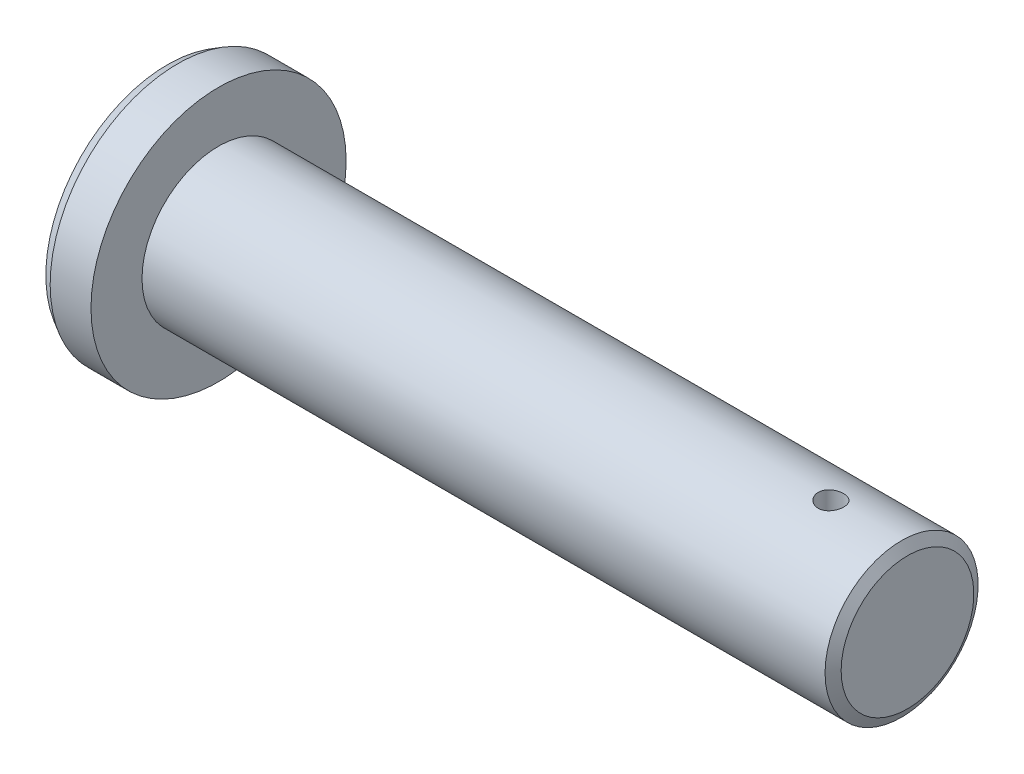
from build123d import *
from OCP.BRepFilletAPI import BRepFilletAPI_MakeChamfer

# Parameters (mm, degrees)
CHANFREIN1_SIZE              = 2
CHANFREIN1_SIZE2             = 1.154700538
ENL_V_MAT_EXTRU_1_DEPTH      = 150.248115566
ENL_V_MAT_EXTRU_1_DEPTH_BACK = 150.248115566
ESQUISSE2_R                  = 2.5


with BuildPart() as part:
    # Esquisse1 → R_volution1 (revolve)
    with BuildSketch(Plane.XY, mode=Mode.PRIVATE) as r_volution1_sk:
        Polygon((0, 0), (0, 25), (10, 25), (10, 15), (145, 15), (145, 0), align=None)
    revolve(r_volution1_sk.sketch.rotate(Axis((-77.045395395, 0, 0), (1, 0, 0)), 90), axis=Axis((-77.045395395, 0, 0), (1, 0, 0)))

    # Chanfrein1: one chamfer whose edges measure the first distance from different faces: ONE call of the kernel's chamfer builder (chamfer() names one face for all edges)
    chanfrein1_edges_1 = [part.edges().sort_by_distance(p)[0] for p in [
        (145, 0, -15),
    ]]
    chanfrein1_side_1 = [part.faces().sort_by_distance(p)[0] for p in [
        (145, 0, 0),
    ]]
    chanfrein1_edges_2 = [part.edges().sort_by_distance(p)[0] for p in [
        (0, 0, -25),
    ]]
    chanfrein1_side_2 = [part.faces().sort_by_distance(p)[0] for p in [
        (5, 0, -25),
    ]]
    chanfrein1 = BRepFilletAPI_MakeChamfer(part.part.solid().wrapped)
    for e in chanfrein1_edges_1:
        chanfrein1.Add(CHANFREIN1_SIZE, CHANFREIN1_SIZE2, e.wrapped, chanfrein1_side_1[0].wrapped)  # the first distance lies on this face
    for e in chanfrein1_edges_2:
        chanfrein1.Add(CHANFREIN1_SIZE, CHANFREIN1_SIZE2, e.wrapped, chanfrein1_side_2[0].wrapped)  # the first distance lies on this face
    add(Compound.cast(chanfrein1.Shape()), mode=Mode.REPLACE)

    # Esquisse2 → Enl_v. mat.-Extru.1 (cut, two sides: drawn at the far end of the back side and taken through both)
    with BuildSketch(Plane(origin=(0, 0, 0), x_dir=(1, 0, 0), z_dir=(0, 1, 0)).offset(-ENL_V_MAT_EXTRU_1_DEPTH_BACK)):
        with Locations(Location((130, 0, 0), (0, 0, 270))):
            Circle(ESQUISSE2_R)
    extrude(amount=ENL_V_MAT_EXTRU_1_DEPTH + ENL_V_MAT_EXTRU_1_DEPTH_BACK, mode=Mode.SUBTRACT)


solid = part.part
